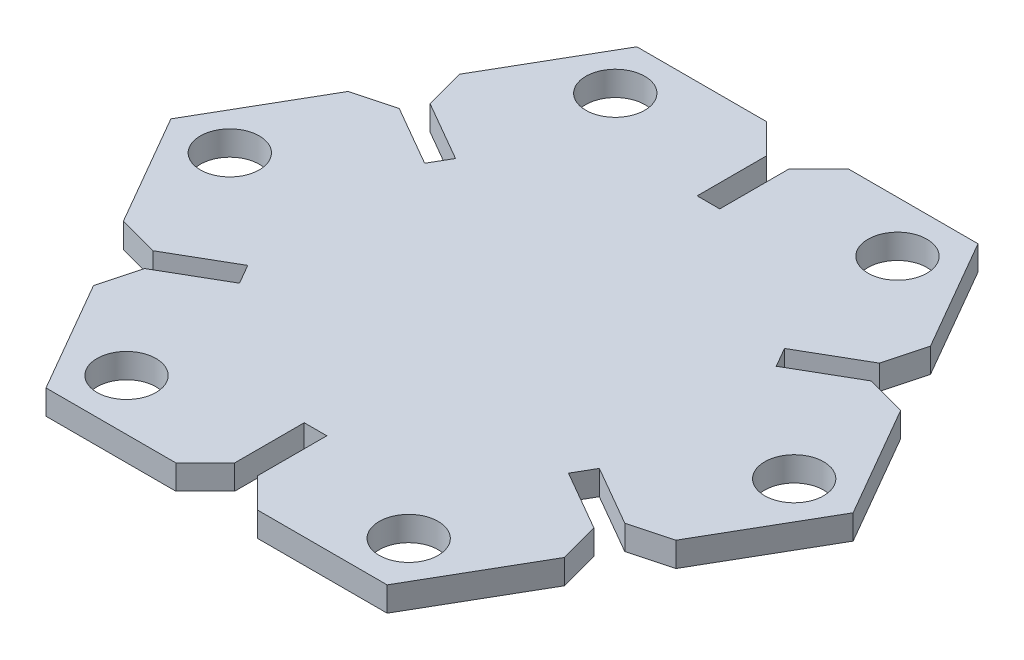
from build123d import *

# Parameters (mm, degrees)
CROQUIS1_R              = 3
SALIENTE_EXTRUIR1_DEPTH = 1.25


with BuildPart() as part:
    # Croquis1 → Saliente-Extruir1 (new, symmetric)
    with BuildSketch(Plane(origin=(0, 0, 0), x_dir=(1, 0, 0), z_dir=(0, 1, 0))):
        Polygon((-17.363809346, 30.075), (-23.970714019, 18.631505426), (-22.872637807, 14.533429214), (-16.745508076, 10.995929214), (-17.895508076, 9.004070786), (-24.022637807, 12.541570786), (-28.120714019, 11.443494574), (-34.727618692, 0), (-28.120714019, -11.443494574), (-24.022637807, -12.541570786), (-17.895508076, -9.004070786), (-16.745508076, -10.995929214), (-22.872637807, -14.533429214), (-23.970714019, -18.631505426), (-17.363809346, -30.075), (-4.15, -30.075), (-1.15, -27.075), (-1.15, -20), (1.15, -20), (1.15, -27.075), (4.15, -30.075), (17.363809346, -30.075), (23.970714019, -18.631505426), (22.872637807, -14.533429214), (16.745508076, -10.995929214), (17.895508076, -9.004070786), (24.022637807, -12.541570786), (28.120714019, -11.443494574), (34.727618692, 0), (28.120714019, 11.443494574), (24.022637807, 12.541570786), (17.895508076, 9.004070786), (16.745508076, 10.995929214), (22.872637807, 14.533429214), (23.970714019, 18.631505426), (17.363809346, 30.075), (4.15, 30.075), (1.15, 27.075), (1.15, 20), (-1.15, 20), (-1.15, 27.075), (-4.15, 30.075), align=None)
        with Locations(Location((14.363809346, 24.878847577, 0), (0, 0, 270))):
            Circle(CROQUIS1_R, mode=Mode.SUBTRACT)
        with Locations(Location((28.727618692, 0, 0), (0, 0, 270))):
            Circle(CROQUIS1_R, mode=Mode.SUBTRACT)
        with Locations(Location((14.363809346, -24.878847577, 0), (0, 0, 270))):
            Circle(CROQUIS1_R, mode=Mode.SUBTRACT)
        with Locations(Location((-14.363809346, -24.878847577, 0), (0, 0, 270))):
            Circle(CROQUIS1_R, mode=Mode.SUBTRACT)
        with Locations(Location((-28.727618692, 0, 0), (0, 0, 270))):
            Circle(CROQUIS1_R, mode=Mode.SUBTRACT)
        with Locations(Location((-14.363809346, 24.878847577, 0), (0, 0, 270))):
            Circle(CROQUIS1_R, mode=Mode.SUBTRACT)
    extrude(amount=SALIENTE_EXTRUIR1_DEPTH, both=True)


solid = part.part
